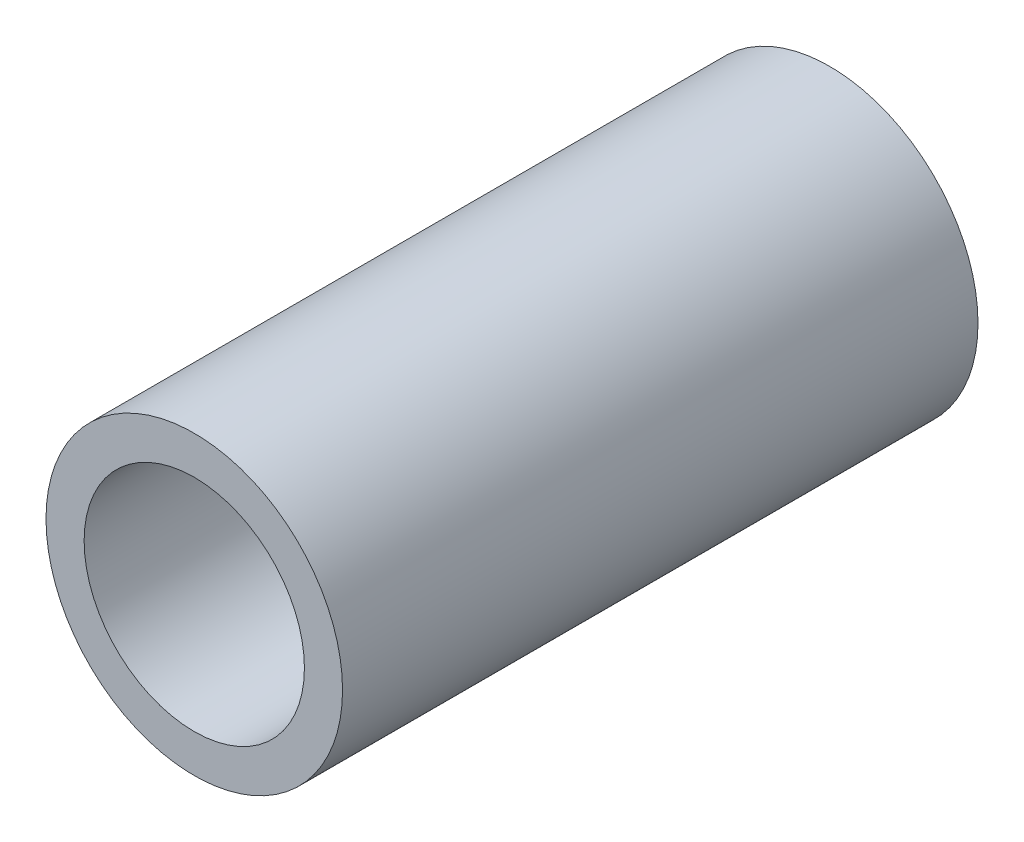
ISO-10303-21;
HEADER;
FILE_DESCRIPTION(('STEP AP214'),'2;1');
FILE_NAME('part.step','',(''),(''),'','','');
FILE_SCHEMA(('AUTOMOTIVE_DESIGN { 1 0 10303 214 1 1 1 1 }'));
ENDSEC;
DATA;
#1=APPLICATION_CONTEXT('core data for automotive mechanical design processes');
#2=APPLICATION_PROTOCOL_DEFINITION('international standard','automotive_design',2000,#1);
#3=PRODUCT_CONTEXT('',#1,'mechanical');
#4=PRODUCT('Part','Part','',(#3));
#5=PRODUCT_RELATED_PRODUCT_CATEGORY('part','',(#4));
#6=PRODUCT_DEFINITION_FORMATION('','',#4);
#7=PRODUCT_DEFINITION_CONTEXT('part definition',#1,'design');
#8=PRODUCT_DEFINITION('design','',#6,#7);
#9=PRODUCT_DEFINITION_SHAPE('','',#8);
#10=(LENGTH_UNIT() NAMED_UNIT(*) SI_UNIT(.MILLI.,.METRE.));
#11=(NAMED_UNIT(*) PLANE_ANGLE_UNIT() SI_UNIT($,.RADIAN.));
#12=(NAMED_UNIT(*) SI_UNIT($,.STERADIAN.) SOLID_ANGLE_UNIT());
#13=UNCERTAINTY_MEASURE_WITH_UNIT(LENGTH_MEASURE(1.E-05),#10,'distance_accuracy_value','');
#14=(GEOMETRIC_REPRESENTATION_CONTEXT(3) GLOBAL_UNCERTAINTY_ASSIGNED_CONTEXT((#13)) GLOBAL_UNIT_ASSIGNED_CONTEXT((#10,
#11,#12)) REPRESENTATION_CONTEXT('',''));
#15=CARTESIAN_POINT('',(0.,0.,0.));
#16=DIRECTION('',(0.,0.,1.));
#17=DIRECTION('',(1.,0.,0.));
#18=AXIS2_PLACEMENT_3D('',#15,#16,#17);
#19=CARTESIAN_POINT('',(0.,0.,150.));
#20=DIRECTION('',(0.,0.,1.));
#21=DIRECTION('',(1.,0.,0.));
#22=AXIS2_PLACEMENT_3D('',#19,#20,#21);
#23=PLANE('',#22);
#24=CARTESIAN_POINT('',(0.,0.,150.));
#25=DIRECTION('',(0.,0.,1.));
#26=DIRECTION('',(1.,0.,0.));
#27=AXIS2_PLACEMENT_3D('',#24,#25,#26);
#28=CIRCLE('',#27,35.);
#29=CARTESIAN_POINT('',(35.,0.,150.));
#30=VERTEX_POINT('',#29);
#31=EDGE_CURVE('E10',#30,#30,#28,.T.);
#32=ORIENTED_EDGE('',*,*,#31,.T.);
#33=EDGE_LOOP('',(#32));
#34=FACE_BOUND('',#33,.T.);
#35=CARTESIAN_POINT('',(0.,0.,150.));
#36=DIRECTION('',(0.,0.,1.));
#37=DIRECTION('',(1.,0.,0.));
#38=AXIS2_PLACEMENT_3D('',#35,#36,#37);
#39=CIRCLE('',#38,26.);
#40=CARTESIAN_POINT('',(26.,0.,150.));
#41=VERTEX_POINT('',#40);
#42=EDGE_CURVE('E50',#41,#41,#39,.T.);
#43=ORIENTED_EDGE('',*,*,#42,.F.);
#44=EDGE_LOOP('',(#43));
#45=FACE_BOUND('',#44,.T.);
#46=ADVANCED_FACE('F39',(#34,#45),#23,.T.);
#47=CARTESIAN_POINT('',(0.,0.,0.));
#48=DIRECTION('',(0.,0.,1.));
#49=DIRECTION('',(1.,0.,0.));
#50=AXIS2_PLACEMENT_3D('',#47,#48,#49);
#51=PLANE('',#50);
#52=CARTESIAN_POINT('',(0.,0.,0.));
#53=DIRECTION('',(0.,0.,1.));
#54=DIRECTION('',(1.,0.,0.));
#55=AXIS2_PLACEMENT_3D('',#52,#53,#54);
#56=CIRCLE('',#55,35.);
#57=CARTESIAN_POINT('',(35.,0.,0.));
#58=VERTEX_POINT('',#57);
#59=EDGE_CURVE('E46',#58,#58,#56,.T.);
#60=ORIENTED_EDGE('',*,*,#59,.F.);
#61=EDGE_LOOP('',(#60));
#62=FACE_BOUND('',#61,.T.);
#63=CARTESIAN_POINT('',(0.,0.,0.));
#64=DIRECTION('',(0.,0.,1.));
#65=DIRECTION('',(1.,0.,0.));
#66=AXIS2_PLACEMENT_3D('',#63,#64,#65);
#67=CIRCLE('',#66,26.);
#68=CARTESIAN_POINT('',(26.,0.,0.));
#69=VERTEX_POINT('',#68);
#70=EDGE_CURVE('E54',#69,#69,#67,.T.);
#71=ORIENTED_EDGE('',*,*,#70,.T.);
#72=EDGE_LOOP('',(#71));
#73=FACE_BOUND('',#72,.T.);
#74=ADVANCED_FACE('F60',(#62,#73),#51,.F.);
#75=CARTESIAN_POINT('',(0.,0.,150.));
#76=DIRECTION('',(0.,0.,-1.));
#77=DIRECTION('',(-1.,0.,0.));
#78=AXIS2_PLACEMENT_3D('',#75,#76,#77);
#79=CYLINDRICAL_SURFACE('',#78,35.);
#80=ORIENTED_EDGE('',*,*,#31,.F.);
#81=EDGE_LOOP('',(#80));
#82=FACE_BOUND('',#81,.T.);
#83=ORIENTED_EDGE('',*,*,#59,.T.);
#84=EDGE_LOOP('',(#83));
#85=FACE_BOUND('',#84,.T.);
#86=ADVANCED_FACE('F41',(#82,#85),#79,.T.);
#87=CARTESIAN_POINT('',(0.,0.,150.));
#88=DIRECTION('',(0.,0.,-1.));
#89=DIRECTION('',(-1.,0.,0.));
#90=AXIS2_PLACEMENT_3D('',#87,#88,#89);
#91=CYLINDRICAL_SURFACE('',#90,26.);
#92=ORIENTED_EDGE('',*,*,#42,.T.);
#93=EDGE_LOOP('',(#92));
#94=FACE_BOUND('',#93,.T.);
#95=ORIENTED_EDGE('',*,*,#70,.F.);
#96=EDGE_LOOP('',(#95));
#97=FACE_BOUND('',#96,.T.);
#98=ADVANCED_FACE('F62',(#94,#97),#91,.F.);
#99=CLOSED_SHELL('',(#46,#74,#86,#98));
#100=MANIFOLD_SOLID_BREP('B2',#99);
#101=ADVANCED_BREP_SHAPE_REPRESENTATION('',(#18,#100),#14);
#102=SHAPE_DEFINITION_REPRESENTATION(#9,#101);
ENDSEC;
END-ISO-10303-21;
